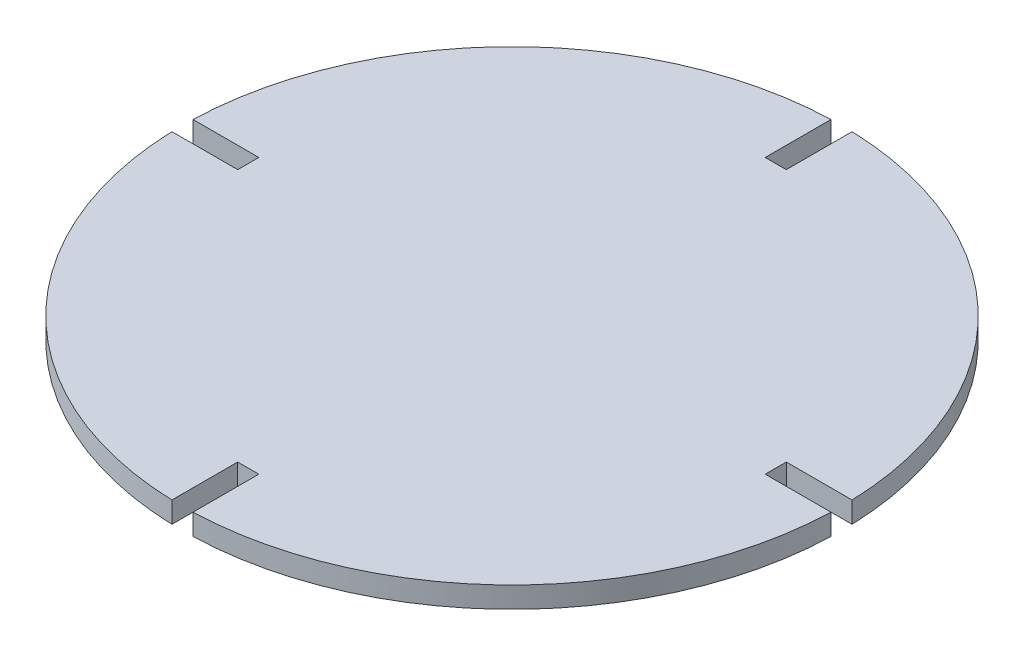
from build123d import *

# Parameters (mm, degrees)
BOSS_EXTRUDE1_DEPTH = 32


with BuildPart() as part:
    # Sketch1 → Boss-Extrude1 (new body)
    with BuildSketch(Plane(origin=(0, 0, 0), x_dir=(1, 0, 0), z_dir=(0, 1, 0))):
        with BuildLine():
            ThreePointArc((-16, 499.74393443), (-353.553390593, 353.553390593), (-499.74393443, 16))
            Line((-499.74393443, 16), (-400, 16))
            Line((-400, 16), (-400, -16))
            Line((-400, -16), (-499.74393443, -16))
            ThreePointArc((-499.74393443, -16), (-353.553390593, -353.553390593), (-16, -499.74393443))
            Line((-16, -499.74393443), (-16, -400))
            Line((-16, -400), (16, -400))
            Line((16, -400), (16, -499.74393443))
            ThreePointArc((16, -499.74393443), (353.553390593, -353.553390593), (499.74393443, -16))
            Line((499.74393443, -16), (400, -16))
            Line((400, -16), (400, 16))
            Line((400, 16), (499.74393443, 16))
            ThreePointArc((499.74393443, 16), (353.553390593, 353.553390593), (16, 499.74393443))
            Line((16, 499.74393443), (16, 400))
            Line((16, 400), (-16, 400))
            Line((-16, 400), (-16, 499.74393443))
        make_face()
    extrude(amount=BOSS_EXTRUDE1_DEPTH)


solid = part.part
